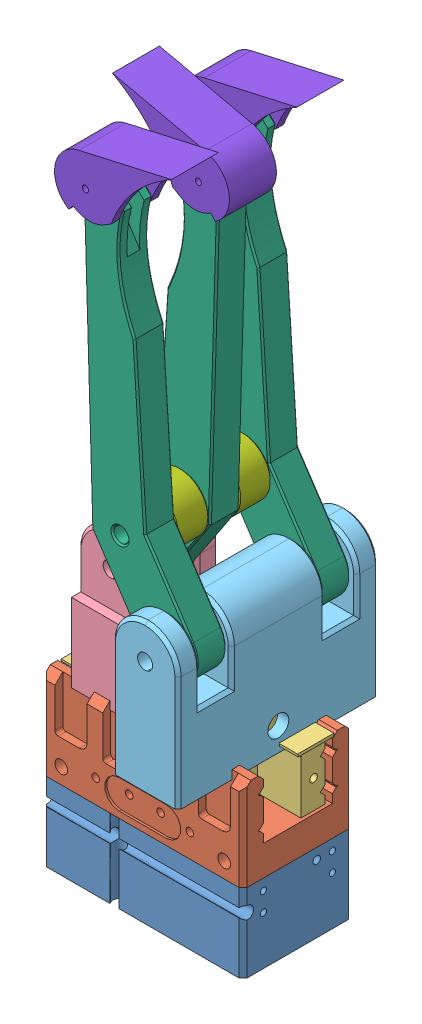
SolidWorks assembly scissor_draft8_assembly.SLDASM, configuration Default (file format 15000). Lengths in mm.
Overall size (125.01 228.54 64).
14 component instances, 8 part files, 36 mates.
Components (placement in the parent):
- SCHUNK-5518814 Gehaeuse MPG-plus 64-1: SCHUNK-5518814 Gehaeuse MPG-plus 64.sldprt [Default] at (0 25 0) x (1 0 0) z (0 0 -1) size (64.01 25 35.01)
- SCHUNK-5518813 Abdeckgehaeuse MPG-plus 64-1: SCHUNK-5518813 Abdeckgehaeuse MPG-plus 64.sldprt [Default] at (0 25 0) x (0 0 1) z (-1 0 0) size (35 29 64)
- SCHUNK-5518813 Finger MPG-plus 64-1: SCHUNK-5518813 Finger MPG-plus 64.sldprt [Default] at (-22 69.7 -0.75) x (-1 0 0) z (0 0 1) size (54 35.1 21.5)
- SCHUNK-5518813 Finger MPG-plus 64-2: SCHUNK-5518813 Finger MPG-plus 64.sldprt [Default] at (22 69.7 0.75) x (1 0 0) z (0 0 -1) size (54 35.1 21.5)
- scissor_attachment_draft4-1: scissor_attachment_draft4.SLDPRT [Default] at (-5 76.2 0.25) x (1 0 0) z (0 0 -1) size (21 47 30)
- scissor_attachment2_draft4-1: scissor_attachment2_draft4.SLDPRT [Default] at (5 76.2 0.25) x (-1 0 0) z (0 0 1) size (21 47 64)
- scissor1prong_draft6-4: scissor1prong_draft6.SLDPRT [Default] at (10.1946 60.8589 20) x (-0.553571 0.832802 0) z (0 0 -1) size (123.58 59.46 9.5)
- scissor-middle-donuts-1: scissor-middle-donuts.SLDPRT [Default] at (0 110.5184 10.44) x (0.999951 0.00993 0) z (0 0 1) size (18 18 10.38)
- scissor_tip_draft7-2: scissor_tip_draft7.SLDPRT [Default] at (5.3693 189.6589 20.25) x (0.510348 -0.859968 0) z (0 0 1) size (18.86 41.77 15)
- scissor_tip_draft7-3: scissor_tip_draft7.SLDPRT [Default] at (-5.3693 189.6589 0.25) x (-0.510348 -0.859968 0) z (0 0 -1) size (18.86 41.77 15)
- scissor_tip_draft7-4: scissor_tip_draft7.SLDPRT [Default] at (5.3693 189.6589 -19.75) x (0.510348 -0.859968 0) z (0 0 1) size (18.86 41.77 15)
- scissor-middle-donuts-2: scissor-middle-donuts.SLDPRT [Default] at (0 110.5184 -9.44) x (0.93655 0.350534 0) z (0 0 1) size (18 18 10.38)
- scissor1prong_draft6-6: scissor1prong_draft6.SLDPRT [Default] at (10.1946 60.8589 -19.5) x (-0.553571 0.832802 0) z (0 0 -1) size (123.58 59.46 9.5)
- scissor1prong_draft6-7: scissor1prong_draft6.SLDPRT [Default] at (-10.1946 60.8589 0.5) x (0.553571 0.832802 0) z (0 0 1) size (123.58 59.46 9.5)
Mates (geometry in assembly coordinates):
- Coincident2: coincident anti-aligned: plane of SCHUNK-5518814 Gehaeuse MPG-plus 64-1 through (-32 25 17.5) normal (0 1 0); plane of SCHUNK-5518813 Abdeckgehaeuse MPG-plus 64-1 through (32 25 -17.5) normal (0 -1 0)
- Coincident3: coincident aligned: plane of SCHUNK-5518814 Gehaeuse MPG-plus 64-1 through (-32 25 -16.2) normal (-1 0 0); plane of SCHUNK-5518813 Abdeckgehaeuse MPG-plus 64-1 through (-32 25 16.2) normal (-1 0 0)
- Coincident4: coincident aligned: plane of SCHUNK-5518814 Gehaeuse MPG-plus 64-1 through (30.7 25 -17.5) normal (0 0 -1); plane of SCHUNK-5518813 Abdeckgehaeuse MPG-plus 64-1 through (-30.7 25 -17.5) normal (0 0 -1)
- Distance4: distance = 1.4 mm anti-aligned: plane of SCHUNK-5518813 Abdeckgehaeuse MPG-plus 64-1 through (-32 40.17 -11) normal (0 0 1); plane of SCHUNK-5518813 Finger MPG-plus 64-1 through (31 47.13 -9.6) normal (0 0 -1)
- Distance5: distance = 3.9 mm anti-aligned: plane of SCHUNK-5518813 Finger MPG-plus 64-1 through (-21 51.4 -1.95) normal (0 0 1); plane of SCHUNK-5518813 Finger MPG-plus 64-2 through (21 51.4 1.95) normal (0 0 -1)
- Coincident10: coincident anti-aligned: plane of SCHUNK-5518813 Abdeckgehaeuse MPG-plus 64-1 through (32 34.6 -11) normal (0 1 0); plane of SCHUNK-5518813 Finger MPG-plus 64-1 through (31 34.6 -1.95) normal (0 -1 0)
- LimitDistance2: limit distance = 10 mm aligned: plane of SCHUNK-5518813 Finger MPG-plus 64-1 through (-22 69.7 -11.5) normal (-1 0 0); plane of SCHUNK-5518813 Abdeckgehaeuse MPG-plus 64-1 through (-32 25 16.2) normal (-1 0 0)
- LimitDistance3: limit distance = 10 mm aligned: plane of SCHUNK-5518813 Finger MPG-plus 64-2 through (22 69.7 11.5) normal (1 0 0); plane of SCHUNK-5518813 Abdeckgehaeuse MPG-plus 64-1 through (32 25 16.2) normal (1 0 0)
- Coincident15: coincident anti-aligned: plane of SCHUNK-5518813 Abdeckgehaeuse MPG-plus 64-1 through (32 34.6 -11) normal (0 1 0); plane of SCHUNK-5518813 Finger MPG-plus 64-2 through (-31 34.6 1.95) normal (0 -1 0)
- Coincident16: coincident anti-aligned: plane of SCHUNK-5518813 Finger MPG-plus 64-1 through (-12 69.7 -10) normal (0 1 0); plane of scissor_attachment_draft4-1 through (-5 69.7 0.25) normal (0 -1 0)
- Coincident17: coincident anti-aligned: plane of SCHUNK-5518813 Finger MPG-plus 64-2 through (12 69.7 10) normal (0 1 0); plane of scissor_attachment2_draft4-1 through (5 69.7 0.25) normal (0 -1 0)
- Coincident18: coincident anti-aligned: plane of SCHUNK-5518813 Finger MPG-plus 64-1 through (-12 69.7 -10) normal (0 0 -1); plane of scissor_attachment_draft4-1 through (-22.5 69.7 -10) normal (0 0 1)
- Coincident19: coincident anti-aligned: plane of SCHUNK-5518813 Finger MPG-plus 64-1 through (-12 69.7 10) normal (1 0 0); plane of scissor_attachment_draft4-1 through (-12 69.7 10.5) normal (-1 0 0)
- Coincident20: coincident anti-aligned: plane of SCHUNK-5518813 Finger MPG-plus 64-2 through (12 69.7 -10) normal (0 0 -1); plane of scissor_attachment2_draft4-1 through (22.5 69.7 -10) normal (0 0 1)
- Coincident21: coincident anti-aligned: plane of SCHUNK-5518813 Finger MPG-plus 64-2 through (12 69.7 -10) normal (-1 0 0); plane of scissor_attachment2_draft4-1 through (12 69.7 -10) normal (1 0 0)
- Concentric1: concentric aligned: cylinder of scissor_attachment_draft4-1 through (-15.5 87.2 15.25) axis (0 0 -1) radius 2.4; cylinder of scissor1prong_draft6-7 through (-15.5 87.2 5.25) axis (0 0 -1) radius 2.4
- Coincident22: coincident anti-aligned: plane of scissor_attachment_draft4-1 through (-26 98.2 5.25) normal (0 0 -1); plane of scissor1prong_draft6-7 through (0.3595 185.0644 5.25) normal (0 0 1)
- Concentric2: concentric aligned: cylinder of scissor-middle-donuts-1 through (0 110.5184 15.63) axis (0 0 -1) radius 2.4; cylinder of scissor1prong_draft6-7 through (0 110.5184 5.25) axis (0 0 -1) radius 2.4
- Concentric3: concentric aligned: cylinder of scissor-middle-donuts-2 through (0 110.5184 -4.25) axis (0 0 -1) radius 2.4; cylinder of scissor1prong_draft6-7 through (0 110.5184 5.25) axis (0 0 -1) radius 2.4
- Coincident23: coincident anti-aligned: plane of scissor-middle-donuts-2 through (0 110.5184 -4.25) normal (0 0 1); plane of scissor1prong_draft6-7 through (0.3595 185.0644 -4.25) normal (0 0 -1)
- Coincident24: coincident anti-aligned: plane of scissor-middle-donuts-1 through (0 110.5184 5.25) normal (0 0 -1); plane of scissor1prong_draft6-7 through (0.3595 185.0644 5.25) normal (0 0 1)
- Concentric4: concentric aligned: cylinder of scissor_attachment2_draft4-1 through (15.5 87.2 -31.75) axis (0 0 1) radius 2.4; cylinder of scissor1prong_draft6-4 through (15.5 87.2 15.25) axis (0 0 1) radius 2.4
- Concentric5: concentric aligned: cylinder of scissor_attachment2_draft4-1 through (15.5 87.2 -31.75) axis (0 0 1) radius 2.4; cylinder of scissor1prong_draft6-6 through (15.5 87.2 -24.25) axis (0 0 1) radius 2.4
- Coincident25: coincident anti-aligned: plane of scissor_attachment2_draft4-1 through (26 98.2 15.25) normal (0 0 1); plane of scissor1prong_draft6-4 through (-0.3595 185.0644 15.25) normal (0 0 -1)
- Coincident26: coincident anti-aligned: plane of scissor_attachment2_draft4-1 through (26 98.2 -14.75) normal (0 0 -1); plane of scissor1prong_draft6-6 through (-0.3595 185.0644 -14.75) normal (0 0 1)
- Concentric6: concentric anti-aligned: cylinder of scissor1prong_draft6-4 through (0 110.5184 15.25) axis (0 0 1) radius 2.4; cylinder of scissor-middle-donuts-1 through (0 110.5184 15.63) axis (0 0 -1) radius 2.4
- Concentric7: concentric anti-aligned: cylinder of scissor-middle-donuts-2 through (0 110.5184 -4.25) axis (0 0 -1) radius 2.4; cylinder of scissor1prong_draft6-6 through (0 110.5184 -24.25) axis (0 0 1) radius 2.4
- Concentric8: concentric anti-aligned: cylinder of scissor1prong_draft6-4 through (-8.0241 203.7754 15.25) axis (0 0 1) radius 1; cylinder of scissor_tip_draft7-2 through (-8.0241 203.7754 27.75) axis (0 0 -1) radius 1
- Concentric9: concentric anti-aligned: cylinder of scissor_tip_draft7-3 through (8.0241 203.7754 -7.25) axis (0 0 1) radius 1; cylinder of scissor1prong_draft6-7 through (8.0241 203.7754 5.25) axis (0 0 -1) radius 1
- Concentric10: concentric anti-aligned: cylinder of scissor_tip_draft7-4 through (-8.0241 203.7754 -12.25) axis (0 0 -1) radius 1; cylinder of scissor1prong_draft6-6 through (-8.0241 203.7754 -24.25) axis (0 0 1) radius 1
- Angle1: planar angle = 1.762783 rad anti-aligned: plane of scissor_tip_draft7-2 through (19.4192 220.0616 27.75) normal (-0.219655 0.975578 0); plane of scissor1prong_draft6-4 through (-12.1622 210.0009 15.25) normal (-0.999566 -0.029471 0)
- Angle2: planar angle = 1.762783 rad anti-aligned: plane of scissor_tip_draft7-4 through (19.4192 220.0616 -12.25) normal (-0.219655 0.975578 0); plane of scissor1prong_draft6-6 through (-12.1622 210.0009 -24.25) normal (-0.999566 -0.029471 0)
- Angle3: planar angle = 1.762783 rad anti-aligned: plane of scissor_tip_draft7-3 through (-19.4192 220.0616 -7.25) normal (0.219655 0.975578 0); plane of scissor1prong_draft6-7 through (12.1622 210.0009 5.25) normal (0.999566 -0.029471 0)
- Coincident30: coincident anti-aligned: plane of scissor1prong_draft6-4 through (-0.3595 185.0644 15.25) normal (0 0 -1); plane of scissor_tip_draft7-2 through (-13.9844 205.5795 15.25) normal (0 0 1)
- Coincident31: coincident anti-aligned: plane of scissor_tip_draft7-4 through (-13.9844 205.5795 -14.75) normal (0 0 -1); plane of scissor1prong_draft6-6 through (-0.3595 185.0644 -14.75) normal (0 0 1)
- Coincident32: coincident anti-aligned: plane of scissor_tip_draft7-3 through (13.9844 205.5795 5.25) normal (0 0 -1); plane of scissor1prong_draft6-7 through (0.3595 185.0644 5.25) normal (0 0 1)
